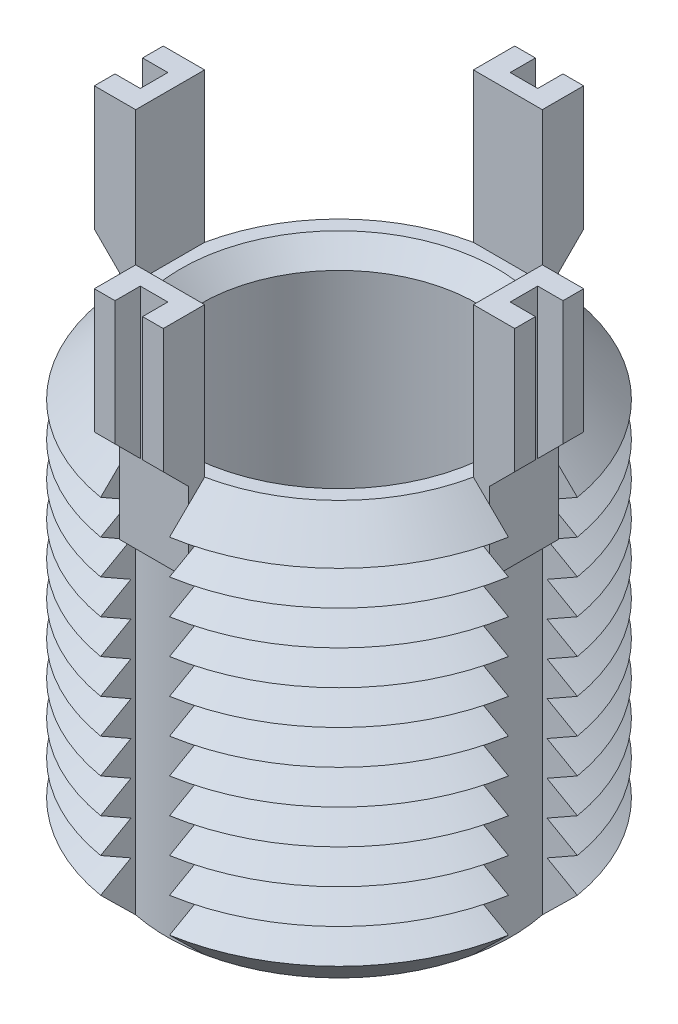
from build123d import *

# Parameters (mm, degrees)
SKETCH1_R               = 9
BOSS_EXTRUDE1_DEPTH     = 18
CHAMFER1_SIZE           = 1.5
LPATTERN1_COUNT         = 10
LPATTERN1_PITCH         = 1.5
CUT_EXTRUDE1_REACH      = 24.045
CIRPATTERN1_COUNT       = 4
BOSS_EXTRUDE3_DEPTH     = 1.5
CIRPATTERN2_COUNT       = 4
CUT_EXTRUDE3_DEPTH      = 28.706298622
CUT_EXTRUDE3_DEPTH_BACK = 28.706298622
SKETCH6_W               = 1.1
SKETCH6_H               = 1.2
SKETCH6_W_2             = 1.2
SKETCH6_H_2             = 1.1
SKETCH7_R               = 6
CUT_EXTRUDE4_DEPTH      = 18
CHAMFER2_SIZE           = 0.875


with BuildPart() as part:
    # Sketch1 → Boss-Extrude1 (new body)
    with BuildSketch(Plane(origin=(0, 0, 0), x_dir=(1, 0, 0), z_dir=(0, 1, 0))):
        with Locations(Location((0, 0, 0), (0, 0, 270))):
            Circle(SKETCH1_R)
    extrude(amount=-BOSS_EXTRUDE1_DEPTH)

    # Chamfer1
    chamfer1_edges = [part.edges().sort_by_distance(p)[0] for p in [
        (0, 0, -9),
        (0, -18, -9),
    ]]
    chamfer(chamfer1_edges, length=CHAMFER1_SIZE)

    # Sketch3 → Cut-Revolve1 (revolve, cut)
    with BuildSketch(Plane(origin=(0, 0, 0), x_dir=(0, 0, -1), z_dir=(1, 0, 0))):
        Polygon((-9, -1.5), (-7.700961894, -2.25), (-9, -3), align=None)
    cut_revolve1 = revolve(axis=Axis((0, 0.885892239, 0), (0, -1, 0)), mode=Mode.SUBTRACT)

    # LPattern1: Cut-Revolve1 ×10
    with Locations(*[(0, -i * LPATTERN1_PITCH, 0) for i in range(1, LPATTERN1_COUNT)]):
        add(cut_revolve1, mode=Mode.SUBTRACT)

    # Cut-Extrude1: up to this cone (the profile starts inside it)
    cut_extrude1_end = Plane(origin=(0, 0, 0), z_dir=(0, 1, 0)).offset(-25.499999) * Cone(1e-06, 75.545, 75.544999, align=(Align.CENTER, Align.CENTER, Align.MIN), mode=Mode.PRIVATE)
    # Sketch4 → Cut-Extrude1 (cut, up to the surface)
    with BuildSketch(Plane(origin=(0, 0, 0), x_dir=(1, 0, 0), z_dir=(0, 1, 0)), mode=Mode.PRIVATE) as cut_extrude1_sk1:
        with BuildLine():
            Line((-7.348469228, 1.5), (-8.874119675, 1.5))
            ThreePointArc((-8.874119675, 1.5), (-9, 0), (-8.874119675, -1.5))
            Line((-8.874119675, -1.5), (-7.348469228, -1.5))
            ThreePointArc((-7.348469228, -1.5), (-7.5, 0), (-7.348469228, 1.5))
        make_face()
    cut_extrude1_tool1 = extrude(cut_extrude1_sk1.sketch, amount=-CUT_EXTRUDE1_REACH, mode=Mode.PRIVATE) & cut_extrude1_end
    cut_extrude1 = cut_extrude1_tool1.solids().sort_by_distance((-8.203718, 0, 0))[0]
    add(cut_extrude1, mode=Mode.SUBTRACT)

    # CirPattern1: Cut-Extrude1 ×4 about axis
    cirpattern1_axis = Axis((0, 0, 0), (0, 1, 0))
    for i in range(1, CIRPATTERN1_COUNT):
        add(cut_extrude1.rotate(cirpattern1_axis, i * 360 / CIRPATTERN1_COUNT), mode=Mode.SUBTRACT)

    # Sketch5 → Boss-Extrude3 (add, symmetric)
    with BuildSketch(Plane(origin=(0, 0, 0), x_dir=(0, 0, -1), z_dir=(1, 0, 0))):
        Polygon((-7.348469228, 6.5), (-7.348469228, -3.5), (-8.048469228, -3.5), (-8.048469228, 0), (-9.148469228, 1.1), (-9.148469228, 6.5), align=None)
    boss_extrude3 = extrude(amount=BOSS_EXTRUDE3_DEPTH, both=True)

    # CirPattern2: Boss-Extrude3 ×4 about axis
    cirpattern2_axis = Axis((0, 0, 0), (0, 1, 0))
    for i in range(1, CIRPATTERN2_COUNT):
        add(boss_extrude3.rotate(cirpattern2_axis, i * 360 / CIRPATTERN2_COUNT))

    # Sketch6 → Cut-Extrude3 (cut, two sides: drawn at the far end of the back side and taken through both)
    with BuildSketch(Plane(origin=(0, 6.5, 0), x_dir=(1, 0, 0), z_dir=(0, 1, 0)).offset(-CUT_EXTRUDE3_DEPTH_BACK)):
        with Locations((-8.598469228, 0)):
            Rectangle(SKETCH6_W, SKETCH6_H)
        with Locations((0, 8.598469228)):
            Rectangle(SKETCH6_W_2, SKETCH6_H_2)
        with Locations((8.598469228, 0)):
            Rectangle(SKETCH6_W, SKETCH6_H)
        with Locations((0, -8.598469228)):
            Rectangle(SKETCH6_W_2, SKETCH6_H_2)
    extrude(amount=CUT_EXTRUDE3_DEPTH + CUT_EXTRUDE3_DEPTH_BACK, mode=Mode.SUBTRACT)

    # Sketch7 → Cut-Extrude4 (cut)
    with BuildSketch(Plane(origin=(0, 0, 0), x_dir=(1, 0, 0), z_dir=(0, 1, 0))):
        with Locations(Location((0, 0, 0), (0, 0, 270))):
            Circle(SKETCH7_R)
    extrude(amount=-CUT_EXTRUDE4_DEPTH, mode=Mode.SUBTRACT)

    # Chamfer2
    chamfer2_edges = [part.edges().sort_by_distance(p)[0] for p in [
        (0, 0, -6),
        (0, -18, -6),
    ]]
    chamfer(chamfer2_edges, length=CHAMFER2_SIZE)


solid = part.part
